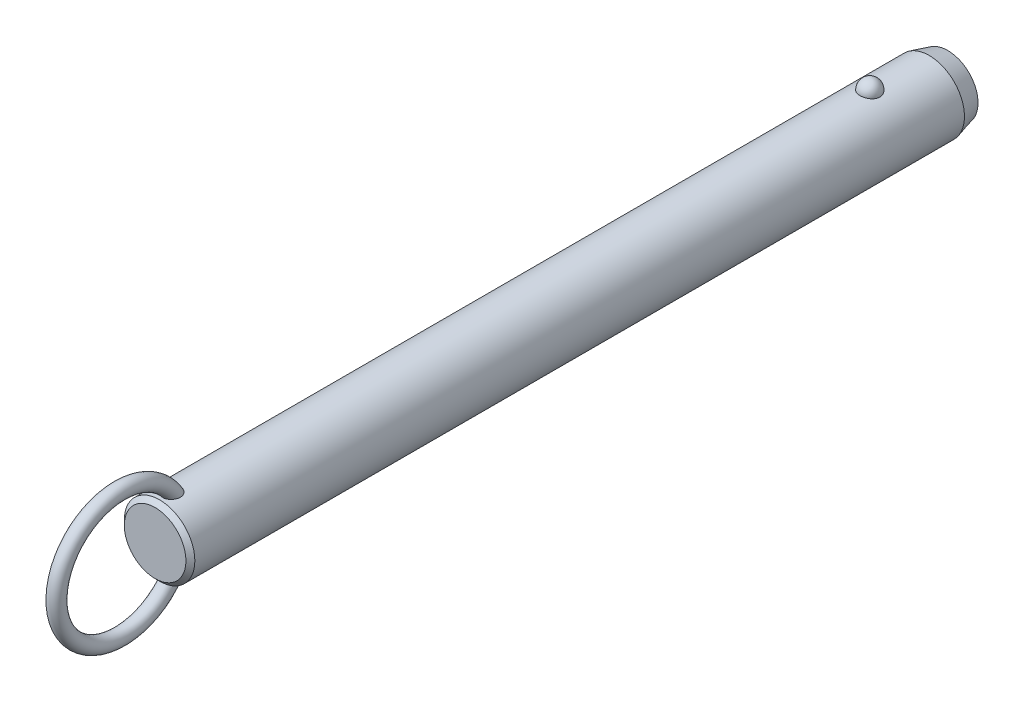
ISO-10303-21;
HEADER;
FILE_DESCRIPTION(('STEP AP214'),'2;1');
FILE_NAME('part.step','',(''),(''),'','','');
FILE_SCHEMA(('AUTOMOTIVE_DESIGN { 1 0 10303 214 1 1 1 1 }'));
ENDSEC;
DATA;
#1=APPLICATION_CONTEXT('core data for automotive mechanical design processes');
#2=APPLICATION_PROTOCOL_DEFINITION('international standard','automotive_design',2000,#1);
#3=PRODUCT_CONTEXT('',#1,'mechanical');
#4=PRODUCT('Part','Part','',(#3));
#5=PRODUCT_RELATED_PRODUCT_CATEGORY('part','',(#4));
#6=PRODUCT_DEFINITION_FORMATION('','',#4);
#7=PRODUCT_DEFINITION_CONTEXT('part definition',#1,'design');
#8=PRODUCT_DEFINITION('design','',#6,#7);
#9=PRODUCT_DEFINITION_SHAPE('','',#8);
#10=(LENGTH_UNIT() NAMED_UNIT(*) SI_UNIT(.MILLI.,.METRE.));
#11=(NAMED_UNIT(*) PLANE_ANGLE_UNIT() SI_UNIT($,.RADIAN.));
#12=(NAMED_UNIT(*) SI_UNIT($,.STERADIAN.) SOLID_ANGLE_UNIT());
#13=UNCERTAINTY_MEASURE_WITH_UNIT(LENGTH_MEASURE(1.E-05),#10,'distance_accuracy_value','');
#14=(GEOMETRIC_REPRESENTATION_CONTEXT(3) GLOBAL_UNCERTAINTY_ASSIGNED_CONTEXT((#13)) GLOBAL_UNIT_ASSIGNED_CONTEXT((#10,
#11,#12)) REPRESENTATION_CONTEXT('',''));
#15=CARTESIAN_POINT('',(0.,0.,0.));
#16=DIRECTION('',(0.,0.,1.));
#17=DIRECTION('',(1.,0.,0.));
#18=AXIS2_PLACEMENT_3D('',#15,#16,#17);
#19=CARTESIAN_POINT('',(0.,0.,180.3));
#20=DIRECTION('',(0.,0.,-1.));
#21=DIRECTION('',(-1.,0.,0.));
#22=AXIS2_PLACEMENT_3D('',#19,#20,#21);
#23=CYLINDRICAL_SURFACE('',#22,9.5);
#24=CARTESIAN_POINT('',(2.67259918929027,9.11631578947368,-2.70000000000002));
#25=CARTESIAN_POINT('',(2.6725968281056,9.11631786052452,-2.54909854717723));
#26=CARTESIAN_POINT('',(2.66030567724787,9.11994722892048,-2.39816735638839));
#27=CARTESIAN_POINT('',(2.6114347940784,9.13405924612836,-2.10058568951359));
#28=CARTESIAN_POINT('',(2.57484658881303,9.14454428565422,-1.95393672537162));
#29=CARTESIAN_POINT('',(2.47830875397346,9.17117631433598,-1.66916069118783));
#30=CARTESIAN_POINT('',(2.41836936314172,9.18732082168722,-1.53102991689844));
#31=CARTESIAN_POINT('',(2.27661331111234,9.22346780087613,-1.26705393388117));
#32=CARTESIAN_POINT('',(2.19479699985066,9.24347021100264,-1.14120852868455));
#33=CARTESIAN_POINT('',(2.01085282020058,9.28522401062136,-0.904632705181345));
#34=CARTESIAN_POINT('',(1.90862396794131,9.30698376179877,-0.793982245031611));
#35=CARTESIAN_POINT('',(1.6867437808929,9.34973971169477,-0.59160721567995));
#36=CARTESIAN_POINT('',(1.56709244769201,9.37073591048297,-0.499882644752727));
#37=CARTESIAN_POINT('',(1.31393976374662,9.40956370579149,-0.338167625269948));
#38=CARTESIAN_POINT('',(1.18048026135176,9.42740444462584,-0.268113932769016));
#39=CARTESIAN_POINT('',(0.903154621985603,9.45799906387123,-0.151390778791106));
#40=CARTESIAN_POINT('',(0.759289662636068,9.47075351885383,-0.104718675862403));
#41=CARTESIAN_POINT('',(0.468074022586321,9.48956256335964,-0.0367633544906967));
#42=CARTESIAN_POINT('',(0.320836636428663,9.49573643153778,-0.0150275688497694));
#43=CARTESIAN_POINT('',(0.0246714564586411,9.50112183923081,0.00396199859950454));
#44=CARTESIAN_POINT('',(-0.124256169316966,9.50033406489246,0.00121819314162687));
#45=CARTESIAN_POINT('',(-0.417264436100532,9.4919475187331,-0.0284441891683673));
#46=CARTESIAN_POINT('',(-0.56138413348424,9.48444885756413,-0.0550074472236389));
#47=CARTESIAN_POINT('',(-0.842986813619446,9.46357853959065,-0.131064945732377));
#48=CARTESIAN_POINT('',(-0.980469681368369,9.450206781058,-0.180559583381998));
#49=CARTESIAN_POINT('',(-1.24585005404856,9.41890822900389,-0.301476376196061));
#50=CARTESIAN_POINT('',(-1.37368611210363,9.40095498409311,-0.373026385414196));
#51=CARTESIAN_POINT('',(-1.61552738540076,9.36242964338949,-0.536025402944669));
#52=CARTESIAN_POINT('',(-1.72953116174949,9.34185727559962,-0.627476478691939));
#53=CARTESIAN_POINT('',(-1.9429225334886,9.29984568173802,-0.829844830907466));
#54=CARTESIAN_POINT('',(-2.04198021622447,9.27839736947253,-0.941108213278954));
#55=CARTESIAN_POINT('',(-2.22026460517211,9.23735994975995,-1.17883414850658));
#56=CARTESIAN_POINT('',(-2.29948985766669,9.21777097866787,-1.30529781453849));
#57=CARTESIAN_POINT('',(-2.43697287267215,9.18238994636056,-1.57158566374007));
#58=CARTESIAN_POINT('',(-2.49497068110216,9.16664569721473,-1.71155057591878));
#59=CARTESIAN_POINT('',(-2.5872073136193,9.14104303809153,-1.99961197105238));
#60=CARTESIAN_POINT('',(-2.62144683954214,9.13118445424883,-2.1477082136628));
#61=CARTESIAN_POINT('',(-2.66521466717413,9.11850622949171,-2.44715424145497));
#62=CARTESIAN_POINT('',(-2.67484831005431,9.11565658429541,-2.59848735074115));
#63=CARTESIAN_POINT('',(-2.66946735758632,9.11723375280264,-2.90067317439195));
#64=CARTESIAN_POINT('',(-2.65445345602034,9.12166036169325,-3.05152590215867));
#65=CARTESIAN_POINT('',(-2.60029711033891,9.13724422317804,-3.34766110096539));
#66=CARTESIAN_POINT('',(-2.56127978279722,9.14836656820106,-3.49296833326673));
#67=CARTESIAN_POINT('',(-2.46018844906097,9.17606676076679,-3.77477535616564));
#68=CARTESIAN_POINT('',(-2.39811349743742,9.1926448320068,-3.91127478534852));
#69=CARTESIAN_POINT('',(-2.25202303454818,9.22952198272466,-4.17244273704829));
#70=CARTESIAN_POINT('',(-2.16788714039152,9.24984129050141,-4.29704106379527));
#71=CARTESIAN_POINT('',(-1.9799408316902,9.29188255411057,-4.53013066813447));
#72=CARTESIAN_POINT('',(-1.87612963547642,9.31360456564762,-4.63862130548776));
#73=CARTESIAN_POINT('',(-1.65105429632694,9.35612959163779,-4.83690299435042));
#74=CARTESIAN_POINT('',(-1.52972405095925,9.37692871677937,-4.9266199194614));
#75=CARTESIAN_POINT('',(-1.27318250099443,9.41518970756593,-5.08429106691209));
#76=CARTESIAN_POINT('',(-1.13797219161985,9.432651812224,-5.15224684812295));
#77=CARTESIAN_POINT('',(-0.859280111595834,9.46208255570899,-5.26371827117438));
#78=CARTESIAN_POINT('',(-0.715925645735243,9.47411833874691,-5.30753421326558));
#79=CARTESIAN_POINT('',(-0.423550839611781,9.4916822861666,-5.37076321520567));
#80=CARTESIAN_POINT('',(-0.2745312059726,9.49721125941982,-5.39017930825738));
#81=CARTESIAN_POINT('',(0.0218446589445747,9.50110860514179,-5.40390587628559));
#82=CARTESIAN_POINT('',(0.16917707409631,9.49961381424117,-5.39869609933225));
#83=CARTESIAN_POINT('',(0.460808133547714,9.48993906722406,-5.36441955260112));
#84=CARTESIAN_POINT('',(0.605106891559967,9.48175936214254,-5.33535367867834));
#85=CARTESIAN_POINT('',(0.886027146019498,9.4596376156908,-5.25435587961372));
#86=CARTESIAN_POINT('',(1.02267710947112,9.44571881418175,-5.20251612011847));
#87=CARTESIAN_POINT('',(1.28523827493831,9.41358993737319,-5.07741549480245));
#88=CARTESIAN_POINT('',(1.41114877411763,9.39537958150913,-5.00415322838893));
#89=CARTESIAN_POINT('',(1.65085227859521,9.3562644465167,-4.83684599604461));
#90=CARTESIAN_POINT('',(1.76442346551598,9.33532178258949,-4.74249218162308));
#91=CARTESIAN_POINT('',(1.97425672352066,9.29321198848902,-4.53620389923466));
#92=CARTESIAN_POINT('',(2.07051582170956,9.27204482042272,-4.42426641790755));
#93=CARTESIAN_POINT('',(2.24490086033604,9.23139221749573,-4.18363183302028));
#94=CARTESIAN_POINT('',(2.32267019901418,9.21194380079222,-4.05466990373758));
#95=CARTESIAN_POINT('',(2.45584092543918,9.1773419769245,-3.78517836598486));
#96=CARTESIAN_POINT('',(2.5112497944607,9.16218713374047,-3.644652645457));
#97=CARTESIAN_POINT('',(2.59380876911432,9.13913522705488,-3.37104301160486));
#98=CARTESIAN_POINT('',(2.62330266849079,9.13064624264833,-3.23871053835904));
#99=CARTESIAN_POINT('',(2.66269870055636,9.11923566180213,-2.97092664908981));
#100=CARTESIAN_POINT('',(2.67260130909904,9.11631393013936,-2.83547530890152));
#101=CARTESIAN_POINT('',(2.67259918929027,9.11631578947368,-2.70000000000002));
#102=B_SPLINE_CURVE_WITH_KNOTS('',3,(#24,#25,#26,#27,#28,#29,#30,#31,#32,#33,#34,#35,#36,#37,
#38,#39,#40,#41,#42,#43,#44,#45,#46,#47,#48,#49,#50,#51,#52,#53,#54,#55,#56,#57,#58,#59,#60,#61,
#62,#63,#64,#65,#66,#67,#68,#69,#70,#71,#72,#73,#74,#75,#76,#77,#78,#79,#80,#81,#82,#83,#84,#85,
#86,#87,#88,#89,#90,#91,#92,#93,#94,#95,#96,#97,#98,#99,#100,#101),.UNSPECIFIED.,.T.,.F.,(4,2,2,
2,2,2,2,2,2,2,2,2,2,2,2,2,2,2,2,2,2,2,2,2,2,2,2,2,2,2,2,2,2,2,2,2,2,2,4),(0.,0.452217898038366,
0.904593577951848,1.35677112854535,1.80894144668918,2.26340676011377,2.71787203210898,
3.17099820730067,3.62407318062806,4.0687883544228,4.51345969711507,4.95160616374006,
5.38976021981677,5.83050358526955,6.27129275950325,6.72071308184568,7.17016633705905,
7.62495278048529,8.07972578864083,8.53254856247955,8.98535859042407,9.43582813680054,
9.88631615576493,10.3393155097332,10.7923328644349,11.2471065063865,11.7018475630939,
12.150795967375,12.599688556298,13.0398725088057,13.4800399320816,13.9184421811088,
14.3568730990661,14.802202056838,15.2476074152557,15.7010097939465,16.1542603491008,
16.5602594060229,16.966248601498),.UNSPECIFIED.);
#103=CARTESIAN_POINT('',(2.67259918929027,9.11631578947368,-2.70000000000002));
#104=VERTEX_POINT('',#103);
#105=EDGE_CURVE('E41',#104,#104,#102,.T.);
#106=ORIENTED_EDGE('',*,*,#105,.T.);
#107=EDGE_LOOP('',(#106));
#108=FACE_BOUND('',#107,.T.);
#109=CARTESIAN_POINT('',(0.,0.,188.62));
#110=DIRECTION('',(0.,0.,1.));
#111=DIRECTION('',(1.,0.,0.));
#112=AXIS2_PLACEMENT_3D('',#109,#110,#111);
#113=CIRCLE('',#112,9.5);
#114=CARTESIAN_POINT('',(9.5,0.,188.62));
#115=VERTEX_POINT('',#114);
#116=EDGE_CURVE('E10',#115,#115,#113,.F.);
#117=ORIENTED_EDGE('',*,*,#116,.T.);
#118=EDGE_LOOP('',(#117));
#119=FACE_BOUND('',#118,.T.);
#120=CARTESIAN_POINT('',(-0.697062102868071,-9.47439269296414,182.967808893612));
#121=CARTESIAN_POINT('',(-0.799579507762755,-9.46685146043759,183.007482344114));
#122=CARTESIAN_POINT('',(-0.898575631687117,-9.45788043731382,183.0559309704));
#123=CARTESIAN_POINT('',(-1.08670047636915,-9.43811593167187,183.168868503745));
#124=CARTESIAN_POINT('',(-1.17583204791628,-9.42732297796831,183.233352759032));
#125=CARTESIAN_POINT('',(-1.34179806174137,-9.40513672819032,183.376209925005));
#126=CARTESIAN_POINT('',(-1.41865133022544,-9.39374438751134,183.454561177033));
#127=CARTESIAN_POINT('',(-1.55860047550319,-9.37154196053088,183.622752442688));
#128=CARTESIAN_POINT('',(-1.62169476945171,-9.3607319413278,183.71259377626));
#129=CARTESIAN_POINT('',(-1.73527695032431,-9.34035749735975,183.904500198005));
#130=CARTESIAN_POINT('',(-1.78522266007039,-9.33085270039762,184.006891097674));
#131=CARTESIAN_POINT('',(-1.86924997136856,-9.3143834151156,184.218148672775));
#132=CARTESIAN_POINT('',(-1.90332570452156,-9.30741986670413,184.327017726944));
#133=CARTESIAN_POINT('',(-1.95893603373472,-9.29588482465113,184.560473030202));
#134=CARTESIAN_POINT('',(-1.97872420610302,-9.29165182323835,184.685489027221));
#135=CARTESIAN_POINT('',(-2.00062129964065,-9.28695978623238,184.937080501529));
#136=CARTESIAN_POINT('',(-2.00272284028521,-9.28650232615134,185.063656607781));
#137=CARTESIAN_POINT('',(-1.98958876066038,-9.28932750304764,185.336815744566));
#138=CARTESIAN_POINT('',(-1.97143366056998,-9.2932400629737,185.483251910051));
#139=CARTESIAN_POINT('',(-1.91479925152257,-9.30507151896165,185.772062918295));
#140=CARTESIAN_POINT('',(-1.87629122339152,-9.31299607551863,185.914431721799));
#141=CARTESIAN_POINT('',(-1.77225683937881,-9.33340232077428,186.215172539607));
#142=CARTESIAN_POINT('',(-1.70334898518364,-9.34641636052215,186.372369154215));
#143=CARTESIAN_POINT('',(-1.58111062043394,-9.36759153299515,186.597517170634));
#144=CARTESIAN_POINT('',(-1.53721459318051,-9.37492619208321,186.670796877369));
#145=CARTESIAN_POINT('',(-1.44302631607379,-9.38988566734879,186.81307405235));
#146=CARTESIAN_POINT('',(-1.39273721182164,-9.39751033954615,186.882073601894));
#147=CARTESIAN_POINT('',(-1.26775962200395,-9.41530678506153,187.036983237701));
#148=CARTESIAN_POINT('',(-1.19052326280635,-9.42548108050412,187.120871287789));
#149=CARTESIAN_POINT('',(-1.02420241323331,-9.44499825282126,187.276008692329));
#150=CARTESIAN_POINT('',(-0.935139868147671,-9.45434261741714,187.347280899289));
#151=CARTESIAN_POINT('',(-0.766610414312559,-9.46930670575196,187.458695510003));
#152=CARTESIAN_POINT('',(-0.689439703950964,-9.47529223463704,187.502235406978));
#153=CARTESIAN_POINT('',(-0.52894200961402,-9.48560294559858,187.57631336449));
#154=CARTESIAN_POINT('',(-0.445620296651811,-9.48992953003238,187.606862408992));
#155=CARTESIAN_POINT('',(-0.273901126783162,-9.49644161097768,187.652579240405));
#156=CARTESIAN_POINT('',(-0.18546574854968,-9.49860811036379,187.66761059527));
#157=CARTESIAN_POINT('',(-0.00734541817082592,-9.5004135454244,187.680149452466));
#158=CARTESIAN_POINT('',(0.0823387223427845,-9.50005405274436,187.677667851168));
#159=CARTESIAN_POINT('',(0.24767927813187,-9.49708301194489,187.656995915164));
#160=CARTESIAN_POINT('',(0.323620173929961,-9.49477609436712,187.640930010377));
#161=CARTESIAN_POINT('',(0.471981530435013,-9.48855917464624,187.597172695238));
#162=CARTESIAN_POINT('',(0.544400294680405,-9.48464840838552,187.569475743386));
#163=CARTESIAN_POINT('',(0.708947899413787,-9.47398336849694,187.49280266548));
#164=CARTESIAN_POINT('',(0.799149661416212,-9.46671310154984,187.439774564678));
#165=CARTESIAN_POINT('',(0.969783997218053,-9.45076225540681,187.319973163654));
#166=CARTESIAN_POINT('',(1.050194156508,-9.44207854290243,187.253169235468));
#167=CARTESIAN_POINT('',(1.23092343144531,-9.42051459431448,187.080759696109));
#168=CARTESIAN_POINT('',(1.32652499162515,-9.40733378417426,186.97026193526));
#169=CARTESIAN_POINT('',(1.49893121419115,-9.38140745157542,186.735561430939));
#170=CARTESIAN_POINT('',(1.5757161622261,-9.36866239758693,186.611344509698));
#171=CARTESIAN_POINT('',(1.71285426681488,-9.34457644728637,186.349389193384));
#172=CARTESIAN_POINT('',(1.77266365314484,-9.33328726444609,186.21136233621));
#173=CARTESIAN_POINT('',(1.87239208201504,-9.31379209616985,185.928051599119));
#174=CARTESIAN_POINT('',(1.91230158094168,-9.3055875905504,185.782764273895));
#175=CARTESIAN_POINT('',(1.97604189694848,-9.29228394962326,185.462028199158));
#176=CARTESIAN_POINT('',(1.9958743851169,-9.28797202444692,185.285724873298));
#177=CARTESIAN_POINT('',(2.0029570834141,-9.28645519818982,184.932414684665));
#178=CARTESIAN_POINT('',(1.99025930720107,-9.28923895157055,184.755409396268));
#179=CARTESIAN_POINT('',(1.93735479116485,-9.30038134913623,184.456338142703));
#180=CARTESIAN_POINT('',(1.90576827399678,-9.30697680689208,184.332667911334));
#181=CARTESIAN_POINT('',(1.8228748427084,-9.32356855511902,184.092329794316));
#182=CARTESIAN_POINT('',(1.77158213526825,-9.33356239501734,183.975656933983));
#183=CARTESIAN_POINT('',(1.64885744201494,-9.35602275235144,183.752706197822));
#184=CARTESIAN_POINT('',(1.57730995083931,-9.36850332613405,183.646492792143));
#185=CARTESIAN_POINT('',(1.41543264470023,-9.39431873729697,183.449553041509));
#186=CARTESIAN_POINT('',(1.32510883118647,-9.40765330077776,183.358821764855));
#187=CARTESIAN_POINT('',(1.13846223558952,-9.43195720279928,183.205033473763));
#188=CARTESIAN_POINT('',(1.04369890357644,-9.44302894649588,183.140094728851));
#189=CARTESIAN_POINT('',(0.843965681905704,-9.46296805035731,183.028038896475));
#190=CARTESIAN_POINT('',(0.739000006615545,-9.47183631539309,182.980914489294));
#191=CARTESIAN_POINT('',(0.528175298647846,-9.48586140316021,182.908117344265));
#192=CARTESIAN_POINT('',(0.422686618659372,-9.49119633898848,182.88140249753));
#193=CARTESIAN_POINT('',(0.208590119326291,-9.49831365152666,182.846013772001));
#194=CARTESIAN_POINT('',(0.0999817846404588,-9.500095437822,182.837342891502));
#195=CARTESIAN_POINT('',(-0.126104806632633,-9.49988861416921,182.838350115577));
#196=CARTESIAN_POINT('',(-0.243578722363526,-9.49757821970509,182.849594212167));
#197=CARTESIAN_POINT('',(-0.474390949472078,-9.48885165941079,182.893167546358));
#198=CARTESIAN_POINT('',(-0.587729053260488,-9.48243528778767,182.925497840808));
#199=CARTESIAN_POINT('',(-0.697062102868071,-9.47439269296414,182.967808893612));
#200=B_SPLINE_CURVE_WITH_KNOTS('',3,(#120,#121,#122,#123,#124,#125,#126,#127,#128,#129,#130,
#131,#132,#133,#134,#135,#136,#137,#138,#139,#140,#141,#142,#143,#144,#145,#146,#147,#148,#149,
#150,#151,#152,#153,#154,#155,#156,#157,#158,#159,#160,#161,#162,#163,#164,#165,#166,#167,#168,
#169,#170,#171,#172,#173,#174,#175,#176,#177,#178,#179,#180,#181,#182,#183,#184,#185,#186,#187,
#188,#189,#190,#191,#192,#193,#194,#195,#196,#197,#198,#199),.UNSPECIFIED.,.T.,.F.,(4,2,2,2,2,2,
2,2,2,2,2,2,2,2,2,2,2,2,2,2,2,2,2,2,2,2,2,2,2,2,2,2,2,2,2,2,2,2,2,4),(0.,0.330119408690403,
0.660143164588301,0.989655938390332,1.31920659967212,1.66074728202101,2.00241415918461,
2.38088696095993,2.75951768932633,3.20065679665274,3.64242004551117,4.15620996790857,
4.41314162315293,4.66994734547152,5.01228664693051,5.35399933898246,5.6194303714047,
5.88463652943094,6.15215502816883,6.4195070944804,6.65144391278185,6.88349136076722,
7.19641200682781,7.51003602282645,7.94779711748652,8.38601491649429,8.83699707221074,
9.28819530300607,9.81778662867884,10.34653170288,10.7284172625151,11.1100280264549,
11.4938603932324,11.8775702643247,12.2220189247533,12.5663259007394,12.8915939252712,
13.2169159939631,13.5689650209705,13.9210316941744),.UNSPECIFIED.);
#201=CARTESIAN_POINT('',(-0.697062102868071,-9.47439269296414,182.967808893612));
#202=VERTEX_POINT('',#201);
#203=EDGE_CURVE('E59',#202,#202,#200,.T.);
#204=ORIENTED_EDGE('',*,*,#203,.T.);
#205=EDGE_LOOP('',(#204));
#206=FACE_BOUND('',#205,.T.);
#207=CARTESIAN_POINT('',(-0.697062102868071,9.47439269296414,182.967808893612));
#208=CARTESIAN_POINT('',(-0.597792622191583,9.48169483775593,182.92939564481));
#209=CARTESIAN_POINT('',(-0.495106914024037,9.48766580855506,182.899168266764));
#210=CARTESIAN_POINT('',(-0.285876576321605,9.49627648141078,182.856032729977));
#211=CARTESIAN_POINT('',(-0.179324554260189,9.49890941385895,182.843159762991));
#212=CARTESIAN_POINT('',(0.0344157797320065,9.50053798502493,182.835166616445));
#213=CARTESIAN_POINT('',(0.141603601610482,9.49953613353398,182.840034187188));
#214=CARTESIAN_POINT('',(0.35356357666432,9.49401038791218,182.867365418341));
#215=CARTESIAN_POINT('',(0.458336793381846,9.48948807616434,182.88982117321));
#216=CARTESIAN_POINT('',(0.662493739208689,9.4774236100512,182.951671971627));
#217=CARTESIAN_POINT('',(0.761881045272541,9.46988348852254,182.991055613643));
#218=CARTESIAN_POINT('',(0.95260839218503,9.45260382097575,183.085634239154));
#219=CARTESIAN_POINT('',(1.04394806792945,9.44286417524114,183.140829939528));
#220=CARTESIAN_POINT('',(1.21712767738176,9.42211760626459,183.266066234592));
#221=CARTESIAN_POINT('',(1.29885671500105,9.41109835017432,183.336257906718));
#222=CARTESIAN_POINT('',(1.44978975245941,9.38903310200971,183.488980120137));
#223=CARTESIAN_POINT('',(1.51899278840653,9.37798710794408,183.571511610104));
#224=CARTESIAN_POINT('',(1.64602857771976,9.35654375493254,183.749776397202));
#225=CARTESIAN_POINT('',(1.70333052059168,9.34618688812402,183.845891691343));
#226=CARTESIAN_POINT('',(1.80259341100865,9.32755128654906,184.045897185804));
#227=CARTESIAN_POINT('',(1.84454942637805,9.31927322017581,184.149789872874));
#228=CARTESIAN_POINT('',(1.91637039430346,9.30478365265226,184.372213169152));
#229=CARTESIAN_POINT('',(1.944805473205,9.29882552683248,184.491219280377));
#230=CARTESIAN_POINT('',(1.98449865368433,9.29043398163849,184.732143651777));
#231=CARTESIAN_POINT('',(1.99574908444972,9.28800213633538,184.854063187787));
#232=CARTESIAN_POINT('',(2.00275141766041,9.28649645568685,185.116932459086));
#233=CARTESIAN_POINT('',(1.99588238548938,9.28799035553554,185.257952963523));
#234=CARTESIAN_POINT('',(1.96270559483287,9.29505517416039,185.537621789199));
#235=CARTESIAN_POINT('',(1.93637872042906,9.30063010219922,185.676267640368));
#236=CARTESIAN_POINT('',(1.85949176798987,9.31633564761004,185.972561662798));
#237=CARTESIAN_POINT('',(1.80549792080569,9.3270926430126,186.129290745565));
#238=CARTESIAN_POINT('',(1.67376869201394,9.3516306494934,186.432284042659));
#239=CARTESIAN_POINT('',(1.59603181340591,9.36541185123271,186.578547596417));
#240=CARTESIAN_POINT('',(1.4360277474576,9.39110706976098,186.825813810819));
#241=CARTESIAN_POINT('',(1.35831795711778,9.40278656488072,186.929791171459));
#242=CARTESIAN_POINT('',(1.18774483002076,9.42585025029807,187.124534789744));
#243=CARTESIAN_POINT('',(1.09490932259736,9.43723493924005,187.215324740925));
#244=CARTESIAN_POINT('',(0.921110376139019,9.45552616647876,187.35620334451));
#245=CARTESIAN_POINT('',(0.843738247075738,9.46281058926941,187.410656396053));
#246=CARTESIAN_POINT('',(0.681245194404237,9.47589120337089,187.506711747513));
#247=CARTESIAN_POINT('',(0.596135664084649,9.48168953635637,187.548332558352));
#248=CARTESIAN_POINT('',(0.433779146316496,9.49038144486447,187.610089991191));
#249=CARTESIAN_POINT('',(0.357459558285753,9.49359170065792,187.63260136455));
#250=CARTESIAN_POINT('',(0.202074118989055,9.49816761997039,187.664574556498));
#251=CARTESIAN_POINT('',(0.123010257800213,9.49953459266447,187.674045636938));
#252=CARTESIAN_POINT('',(-0.03573724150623,9.50026497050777,187.679114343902));
#253=CARTESIAN_POINT('',(-0.115421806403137,9.49962433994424,187.674684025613));
#254=CARTESIAN_POINT('',(-0.272823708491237,9.49640854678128,187.652296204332));
#255=CARTESIAN_POINT('',(-0.350540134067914,9.4938325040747,187.634332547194));
#256=CARTESIAN_POINT('',(-0.500580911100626,9.48709462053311,187.586802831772));
#257=CARTESIAN_POINT('',(-0.572979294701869,9.48296359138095,187.557461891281));
#258=CARTESIAN_POINT('',(-0.712864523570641,9.47347609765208,187.489008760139));
#259=CARTESIAN_POINT('',(-0.780349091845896,9.46811906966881,187.449892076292));
#260=CARTESIAN_POINT('',(-0.946309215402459,9.45329720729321,187.339432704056));
#261=CARTESIAN_POINT('',(-1.04090230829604,9.44321512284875,187.262329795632));
#262=CARTESIAN_POINT('',(-1.21661929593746,9.42219227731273,187.09409718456));
#263=CARTESIAN_POINT('',(-1.29770519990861,9.41124921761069,187.002929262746));
#264=CARTESIAN_POINT('',(-1.47319646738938,9.38563439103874,186.776162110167));
#265=CARTESIAN_POINT('',(-1.56208878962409,9.37102009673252,186.636289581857));
#266=CARTESIAN_POINT('',(-1.71623987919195,9.34401559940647,186.343950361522));
#267=CARTESIAN_POINT('',(-1.78147866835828,9.33162728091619,186.191473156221));
#268=CARTESIAN_POINT('',(-1.88853837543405,9.31055541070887,185.875647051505));
#269=CARTESIAN_POINT('',(-1.92998995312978,9.30193076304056,185.712168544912));
#270=CARTESIAN_POINT('',(-1.98590726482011,9.29015757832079,185.380526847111));
#271=CARTESIAN_POINT('',(-2.0004070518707,9.2870021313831,185.212369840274));
#272=CARTESIAN_POINT('',(-1.99964701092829,9.28716218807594,184.905080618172));
#273=CARTESIAN_POINT('',(-1.98908145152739,9.28945704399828,184.765936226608));
#274=CARTESIAN_POINT('',(-1.94566294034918,9.29865169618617,184.491153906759));
#275=CARTESIAN_POINT('',(-1.9128206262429,9.30554929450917,184.355514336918));
#276=CARTESIAN_POINT('',(-1.84582133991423,9.31898248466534,184.157802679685));
#277=CARTESIAN_POINT('',(-1.82038084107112,9.32400364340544,184.092583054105));
#278=CARTESIAN_POINT('',(-1.76350511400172,9.33492884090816,183.964903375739));
#279=CARTESIAN_POINT('',(-1.73207305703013,9.34083241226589,183.902441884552));
#280=CARTESIAN_POINT('',(-1.66324243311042,9.35333332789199,183.78094078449));
#281=CARTESIAN_POINT('',(-1.62584239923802,9.35993084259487,183.721902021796));
#282=CARTESIAN_POINT('',(-1.54527678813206,9.37356864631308,183.607987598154));
#283=CARTESIAN_POINT('',(-1.50211241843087,9.38060884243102,183.553111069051));
#284=CARTESIAN_POINT('',(-1.3768114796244,9.40004442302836,183.409961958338));
#285=CARTESIAN_POINT('',(-1.28916358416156,9.41261047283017,183.326429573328));
#286=CARTESIAN_POINT('',(-1.09996826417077,9.43658180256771,183.177236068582));
#287=CARTESIAN_POINT('',(-0.998461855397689,9.44799034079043,183.111523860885));
#288=CARTESIAN_POINT('',(-0.860188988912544,9.46103017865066,183.0394367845));
#289=CARTESIAN_POINT('',(-0.828141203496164,9.46389141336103,183.023851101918));
#290=CARTESIAN_POINT('',(-0.763210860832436,9.46934915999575,182.994473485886));
#291=CARTESIAN_POINT('',(-0.730328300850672,9.47194567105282,182.980681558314));
#292=CARTESIAN_POINT('',(-0.697062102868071,9.47439269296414,182.967808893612));
#293=B_SPLINE_CURVE_WITH_KNOTS('',3,(#207,#208,#209,#210,#211,#212,#213,#214,#215,#216,#217,
#218,#219,#220,#221,#222,#223,#224,#225,#226,#227,#228,#229,#230,#231,#232,#233,#234,#235,#236,
#237,#238,#239,#240,#241,#242,#243,#244,#245,#246,#247,#248,#249,#250,#251,#252,#253,#254,#255,
#256,#257,#258,#259,#260,#261,#262,#263,#264,#265,#266,#267,#268,#269,#270,#271,#272,#273,#274,
#275,#276,#277,#278,#279,#280,#281,#282,#283,#284,#285,#286,#287,#288,#289,#290,#291,#292),
.UNSPECIFIED.,.T.,.F.,(4,2,2,2,2,2,2,2,2,2,2,2,2,2,2,2,2,2,2,2,2,2,2,2,2,2,2,2,2,2,2,2,2,2,2,2,
2,2,2,2,2,2,4),(0.,0.319942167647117,0.640532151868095,0.96090081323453,1.2811255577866,
1.60113495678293,1.92115886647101,2.24457323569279,2.56801248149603,2.90371927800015,
3.23953387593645,3.60560313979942,3.97183576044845,4.39383693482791,4.8162532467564,
5.31257045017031,5.80891895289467,6.19868344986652,6.58773876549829,6.87145417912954,
7.15475838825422,7.39263751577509,7.63034760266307,7.86853584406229,8.10683246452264,
8.3406366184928,8.57454843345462,8.93983939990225,9.30614105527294,9.80266668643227,
10.2996107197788,10.8040753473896,11.3079021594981,11.7249776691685,12.1418541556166,
12.3521485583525,12.5623319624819,12.7725671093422,12.9827582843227,13.345827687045,
13.7078449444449,13.8150604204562,13.9222762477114),.UNSPECIFIED.);
#294=CARTESIAN_POINT('',(-0.697062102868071,9.47439269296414,182.967808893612));
#295=VERTEX_POINT('',#294);
#296=EDGE_CURVE('E67',#295,#295,#293,.T.);
#297=ORIENTED_EDGE('',*,*,#296,.T.);
#298=EDGE_LOOP('',(#297));
#299=FACE_BOUND('',#298,.T.);
#300=CARTESIAN_POINT('',(0.,0.,-18.7));
#301=DIRECTION('',(0.,0.,-1.));
#302=DIRECTION('',(-1.,0.,0.));
#303=AXIS2_PLACEMENT_3D('',#300,#301,#302);
#304=CIRCLE('',#303,9.5);
#305=CARTESIAN_POINT('',(-9.5,0.,-18.7));
#306=VERTEX_POINT('',#305);
#307=EDGE_CURVE('E56',#306,#306,#304,.F.);
#308=ORIENTED_EDGE('',*,*,#307,.T.);
#309=EDGE_LOOP('',(#308));
#310=FACE_BOUND('',#309,.T.);
#311=ADVANCED_FACE('F37',(#108,#119,#206,#299,#310),#23,.T.);
#312=CARTESIAN_POINT('',(0.,0.,-23.7));
#313=DIRECTION('',(0.,0.,-1.));
#314=DIRECTION('',(-1.,0.,0.));
#315=AXIS2_PLACEMENT_3D('',#312,#313,#314);
#316=PLANE('',#315);
#317=CARTESIAN_POINT('',(0.,0.,-23.7));
#318=DIRECTION('',(0.,0.,-1.));
#319=DIRECTION('',(-1.,0.,0.));
#320=AXIS2_PLACEMENT_3D('',#317,#318,#319);
#321=CIRCLE('',#320,8.16025403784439);
#322=CARTESIAN_POINT('',(-8.16025403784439,0.,-23.7));
#323=VERTEX_POINT('',#322);
#324=EDGE_CURVE('E66',#323,#323,#321,.T.);
#325=ORIENTED_EDGE('',*,*,#324,.T.);
#326=EDGE_LOOP('',(#325));
#327=FACE_BOUND('',#326,.T.);
#328=ADVANCED_FACE('F85',(#327),#316,.T.);
#329=CARTESIAN_POINT('',(0.,0.,-23.7));
#330=DIRECTION('',(0.,0.,1.));
#331=DIRECTION('',(1.,0.,0.));
#332=AXIS2_PLACEMENT_3D('',#329,#330,#331);
#333=CONICAL_SURFACE('',#332,8.16025403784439,0.261799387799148);
#334=ORIENTED_EDGE('',*,*,#307,.F.);
#335=EDGE_LOOP('',(#334));
#336=FACE_BOUND('',#335,.T.);
#337=ORIENTED_EDGE('',*,*,#324,.F.);
#338=EDGE_LOOP('',(#337));
#339=FACE_BOUND('',#338,.T.);
#340=ADVANCED_FACE('F83',(#336,#339),#333,.T.);
#341=CARTESIAN_POINT('',(0.,0.,189.82));
#342=DIRECTION('',(0.,0.,1.));
#343=DIRECTION('',(1.,0.,0.));
#344=AXIS2_PLACEMENT_3D('',#341,#342,#343);
#345=PLANE('',#344);
#346=CARTESIAN_POINT('',(0.,0.,189.82));
#347=DIRECTION('',(0.,0.,1.));
#348=DIRECTION('',(1.,0.,0.));
#349=AXIS2_PLACEMENT_3D('',#346,#347,#348);
#350=CIRCLE('',#349,8.3);
#351=CARTESIAN_POINT('',(8.3,0.,189.82));
#352=VERTEX_POINT('',#351);
#353=EDGE_CURVE('E50',#352,#352,#350,.T.);
#354=ORIENTED_EDGE('',*,*,#353,.T.);
#355=EDGE_LOOP('',(#354));
#356=FACE_BOUND('',#355,.T.);
#357=ADVANCED_FACE('F77',(#356),#345,.T.);
#358=CARTESIAN_POINT('',(0.,0.,199.35));
#359=DIRECTION('',(1.,0.,0.));
#360=DIRECTION('',(0.,0.,-1.));
#361=AXIS2_PLACEMENT_3D('',#358,#359,#360);
#362=TOROIDAL_SURFACE('',#361,17.05,2.);
#363=ORIENTED_EDGE('',*,*,#296,.F.);
#364=EDGE_LOOP('',(#363));
#365=FACE_BOUND('',#364,.T.);
#366=ORIENTED_EDGE('',*,*,#203,.F.);
#367=EDGE_LOOP('',(#366));
#368=FACE_BOUND('',#367,.T.);
#369=ADVANCED_FACE('F73',(#365,#368),#362,.T.);
#370=CARTESIAN_POINT('',(0.,0.,189.82));
#371=DIRECTION('',(0.,0.,-1.));
#372=DIRECTION('',(-1.,0.,0.));
#373=AXIS2_PLACEMENT_3D('',#370,#371,#372);
#374=CONICAL_SURFACE('',#373,8.3,0.785398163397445);
#375=ORIENTED_EDGE('',*,*,#116,.F.);
#376=EDGE_LOOP('',(#375));
#377=FACE_BOUND('',#376,.T.);
#378=ORIENTED_EDGE('',*,*,#353,.F.);
#379=EDGE_LOOP('',(#378));
#380=FACE_BOUND('',#379,.T.);
#381=ADVANCED_FACE('F39',(#377,#380),#374,.T.);
#382=CARTESIAN_POINT('',(0.,9.5,-2.70000000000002));
#383=DIRECTION('',(0.,1.,0.));
#384=DIRECTION('',(0.,0.,-1.));
#385=AXIS2_PLACEMENT_3D('',#382,#383,#384);
#386=SPHERICAL_SURFACE('',#385,2.7);
#387=ORIENTED_EDGE('',*,*,#105,.F.);
#388=EDGE_LOOP('',(#387));
#389=FACE_BOUND('',#388,.T.);
#390=ADVANCED_FACE('F79',(#389),#386,.T.);
#391=CLOSED_SHELL('',(#311,#328,#340,#357,#369,#381,#390));
#392=MANIFOLD_SOLID_BREP('B2',#391);
#393=ADVANCED_BREP_SHAPE_REPRESENTATION('',(#18,#392),#14);
#394=SHAPE_DEFINITION_REPRESENTATION(#9,#393);
ENDSEC;
END-ISO-10303-21;
